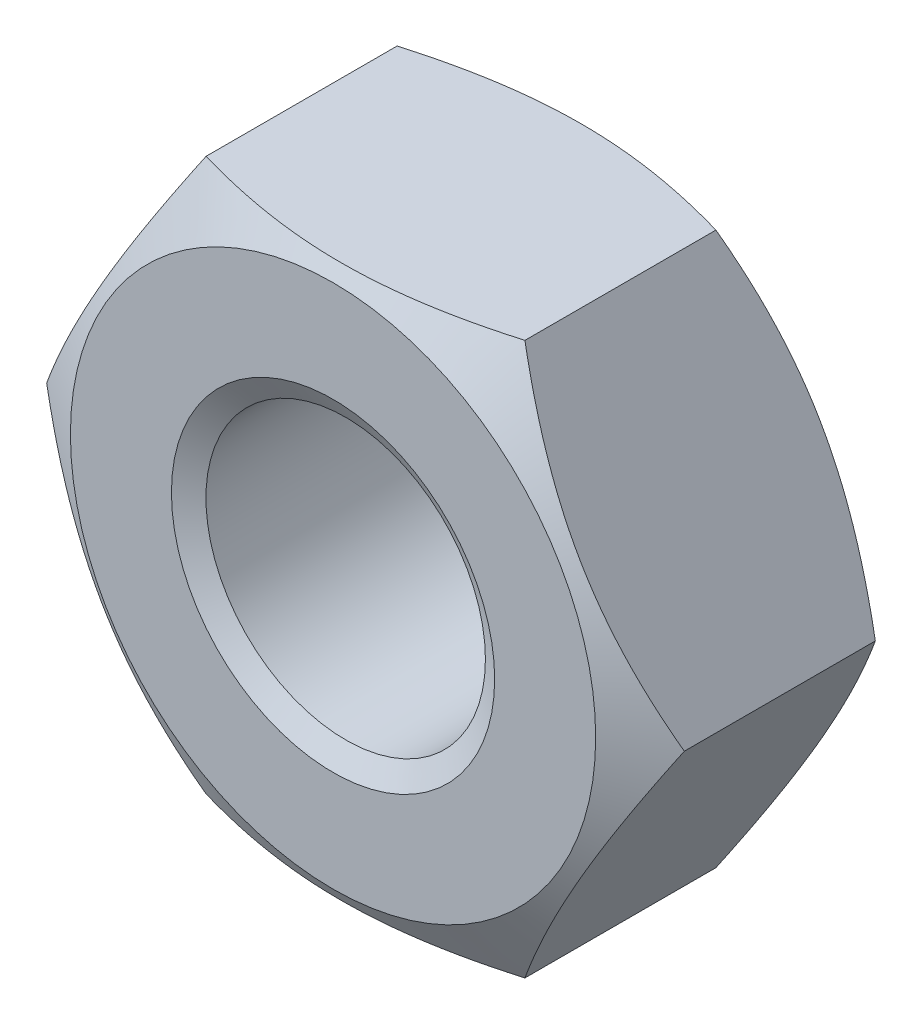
ISO-10303-21;
HEADER;
FILE_DESCRIPTION(('STEP AP214'),'2;1');
FILE_NAME('part.step','',(''),(''),'','','');
FILE_SCHEMA(('AUTOMOTIVE_DESIGN { 1 0 10303 214 1 1 1 1 }'));
ENDSEC;
DATA;
#1=APPLICATION_CONTEXT('core data for automotive mechanical design processes');
#2=APPLICATION_PROTOCOL_DEFINITION('international standard','automotive_design',2000,#1);
#3=PRODUCT_CONTEXT('',#1,'mechanical');
#4=PRODUCT('Part','Part','',(#3));
#5=PRODUCT_RELATED_PRODUCT_CATEGORY('part','',(#4));
#6=PRODUCT_DEFINITION_FORMATION('','',#4);
#7=PRODUCT_DEFINITION_CONTEXT('part definition',#1,'design');
#8=PRODUCT_DEFINITION('design','',#6,#7);
#9=PRODUCT_DEFINITION_SHAPE('','',#8);
#10=(LENGTH_UNIT() NAMED_UNIT(*) SI_UNIT(.MILLI.,.METRE.));
#11=(NAMED_UNIT(*) PLANE_ANGLE_UNIT() SI_UNIT($,.RADIAN.));
#12=(NAMED_UNIT(*) SI_UNIT($,.STERADIAN.) SOLID_ANGLE_UNIT());
#13=UNCERTAINTY_MEASURE_WITH_UNIT(LENGTH_MEASURE(1.E-05),#10,'distance_accuracy_value','');
#14=(GEOMETRIC_REPRESENTATION_CONTEXT(3) GLOBAL_UNCERTAINTY_ASSIGNED_CONTEXT((#13)) GLOBAL_UNIT_ASSIGNED_CONTEXT((#10,
#11,#12)) REPRESENTATION_CONTEXT('',''));
#15=CARTESIAN_POINT('',(0.,0.,0.));
#16=DIRECTION('',(0.,0.,1.));
#17=DIRECTION('',(1.,0.,0.));
#18=AXIS2_PLACEMENT_3D('',#15,#16,#17);
#19=CARTESIAN_POINT('',(0.,0.,0.468736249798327));
#20=DIRECTION('',(0.,0.,-1.));
#21=DIRECTION('',(1.,0.,0.));
#22=AXIS2_PLACEMENT_3D('',#19,#20,#21);
#23=CONICAL_SURFACE('',#22,11.188125,1.0471975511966);
#24=CARTESIAN_POINT('',(0.,0.,0.937472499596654));
#25=DIRECTION('',(0.,0.,1.));
#26=DIRECTION('',(1.,0.,0.));
#27=AXIS2_PLACEMENT_3D('',#24,#25,#26);
#28=CIRCLE('',#27,10.37625);
#29=CARTESIAN_POINT('',(10.37625,0.,0.937472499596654));
#30=VERTEX_POINT('',#29);
#31=EDGE_CURVE('E12',#30,#30,#28,.T.);
#32=ORIENTED_EDGE('',*,*,#31,.T.);
#33=EDGE_LOOP('',(#32));
#34=FACE_BOUND('',#33,.T.);
#35=CARTESIAN_POINT('',(0.,0.,0.));
#36=DIRECTION('',(0.,0.,1.));
#37=DIRECTION('',(1.,0.,0.));
#38=AXIS2_PLACEMENT_3D('',#35,#36,#37);
#39=CIRCLE('',#38,12.);
#40=CARTESIAN_POINT('',(12.,0.,0.));
#41=VERTEX_POINT('',#40);
#42=EDGE_CURVE('E194',#41,#41,#39,.T.);
#43=ORIENTED_EDGE('',*,*,#42,.F.);
#44=EDGE_LOOP('',(#43));
#45=FACE_BOUND('',#44,.T.);
#46=ADVANCED_FACE('F19',(#34,#45),#23,.F.);
#47=CARTESIAN_POINT('',(0.,0.,9.5));
#48=DIRECTION('',(0.,0.,-1.));
#49=DIRECTION('',(1.,0.,0.));
#50=AXIS2_PLACEMENT_3D('',#47,#48,#49);
#51=CYLINDRICAL_SURFACE('',#50,10.37625);
#52=CARTESIAN_POINT('',(0.,0.,18.0625275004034));
#53=DIRECTION('',(0.,0.,1.));
#54=DIRECTION('',(1.,0.,0.));
#55=AXIS2_PLACEMENT_3D('',#52,#53,#54);
#56=CIRCLE('',#55,10.37625);
#57=CARTESIAN_POINT('',(10.37625,0.,18.0625275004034));
#58=VERTEX_POINT('',#57);
#59=EDGE_CURVE('E30',#58,#58,#56,.T.);
#60=ORIENTED_EDGE('',*,*,#59,.T.);
#61=EDGE_LOOP('',(#60));
#62=FACE_BOUND('',#61,.T.);
#63=ORIENTED_EDGE('',*,*,#31,.F.);
#64=EDGE_LOOP('',(#63));
#65=FACE_BOUND('',#64,.T.);
#66=ADVANCED_FACE('F265',(#62,#65),#51,.F.);
#67=CARTESIAN_POINT('',(0.,0.,18.5312637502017));
#68=DIRECTION('',(0.,0.,1.));
#69=DIRECTION('',(1.,0.,0.));
#70=AXIS2_PLACEMENT_3D('',#67,#68,#69);
#71=CONICAL_SURFACE('',#70,11.188125,1.0471975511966);
#72=CARTESIAN_POINT('',(0.,0.,19.));
#73=DIRECTION('',(0.,0.,-1.));
#74=DIRECTION('',(1.,0.,0.));
#75=AXIS2_PLACEMENT_3D('',#72,#73,#74);
#76=CIRCLE('',#75,12.);
#77=CARTESIAN_POINT('',(12.,0.,19.));
#78=VERTEX_POINT('',#77);
#79=EDGE_CURVE('E117',#78,#78,#76,.T.);
#80=ORIENTED_EDGE('',*,*,#79,.F.);
#81=EDGE_LOOP('',(#80));
#82=FACE_BOUND('',#81,.T.);
#83=ORIENTED_EDGE('',*,*,#59,.F.);
#84=EDGE_LOOP('',(#83));
#85=FACE_BOUND('',#84,.T.);
#86=ADVANCED_FACE('F262',(#82,#85),#71,.F.);
#87=CARTESIAN_POINT('',(0.,0.,1.20416820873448));
#88=DIRECTION('',(0.,0.,1.));
#89=DIRECTION('',(1.,0.,0.));
#90=AXIS2_PLACEMENT_3D('',#87,#88,#89);
#91=CONICAL_SURFACE('',#90,21.5856805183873,1.0471975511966);
#92=CARTESIAN_POINT('',(23.6713610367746,0.,2.40833641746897));
#93=CARTESIAN_POINT('',(17.753520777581,-10.25,-1.0083302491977));
#94=CARTESIAN_POINT('',(11.8356805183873,-20.5,2.40833641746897));
#95=(BOUNDED_CURVE() B_SPLINE_CURVE(2,(#92,#93,#94),.UNSPECIFIED.,.F.,
.F.) B_SPLINE_CURVE_WITH_KNOTS((3,3),(0.,23.9529408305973),
.UNSPECIFIED.) CURVE() GEOMETRIC_REPRESENTATION_ITEM() RATIONAL_B_SPLINE_CURVE((1.,
1.15470053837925,1.)) REPRESENTATION_ITEM(''));
#96=CARTESIAN_POINT('',(23.6713610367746,0.,2.40833641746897));
#97=VERTEX_POINT('',#96);
#98=CARTESIAN_POINT('',(11.8356805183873,-20.5,2.40833641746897));
#99=VERTEX_POINT('',#98);
#100=EDGE_CURVE('E103',#97,#99,#95,.T.);
#101=ORIENTED_EDGE('',*,*,#100,.T.);
#102=CARTESIAN_POINT('',(11.8356805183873,-20.5,2.40833641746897));
#103=CARTESIAN_POINT('',(0.,-20.5,-1.00833024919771));
#104=CARTESIAN_POINT('',(-11.8356805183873,-20.5,2.40833641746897));
#105=(BOUNDED_CURVE() B_SPLINE_CURVE(2,(#102,#103,#104),.UNSPECIFIED.,.F.,
.F.) B_SPLINE_CURVE_WITH_KNOTS((3,3),(0.,23.9529408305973),
.UNSPECIFIED.) CURVE() GEOMETRIC_REPRESENTATION_ITEM() RATIONAL_B_SPLINE_CURVE((1.,
1.15470053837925,1.)) REPRESENTATION_ITEM(''));
#106=CARTESIAN_POINT('',(-11.8356805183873,-20.5,2.40833641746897));
#107=VERTEX_POINT('',#106);
#108=EDGE_CURVE('E96',#99,#107,#105,.T.);
#109=ORIENTED_EDGE('',*,*,#108,.T.);
#110=CARTESIAN_POINT('',(-11.8356805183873,-20.5,2.40833641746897));
#111=CARTESIAN_POINT('',(-17.753520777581,-10.25,-1.0083302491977));
#112=CARTESIAN_POINT('',(-23.6713610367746,0.,2.40833641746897));
#113=(BOUNDED_CURVE() B_SPLINE_CURVE(2,(#110,#111,#112),.UNSPECIFIED.,.F.,
.F.) B_SPLINE_CURVE_WITH_KNOTS((3,3),(0.,23.9529408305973),
.UNSPECIFIED.) CURVE() GEOMETRIC_REPRESENTATION_ITEM() RATIONAL_B_SPLINE_CURVE((1.,
1.15470053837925,1.)) REPRESENTATION_ITEM(''));
#114=CARTESIAN_POINT('',(-23.6713610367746,0.,2.40833641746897));
#115=VERTEX_POINT('',#114);
#116=EDGE_CURVE('E86',#107,#115,#113,.T.);
#117=ORIENTED_EDGE('',*,*,#116,.T.);
#118=CARTESIAN_POINT('',(-23.6713610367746,0.,2.40833641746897));
#119=CARTESIAN_POINT('',(-17.753520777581,10.25,-1.00833024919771));
#120=CARTESIAN_POINT('',(-11.8356805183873,20.5,2.40833641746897));
#121=(BOUNDED_CURVE() B_SPLINE_CURVE(2,(#118,#119,#120),.UNSPECIFIED.,.F.,
.F.) B_SPLINE_CURVE_WITH_KNOTS((3,3),(0.,23.9529408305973),
.UNSPECIFIED.) CURVE() GEOMETRIC_REPRESENTATION_ITEM() RATIONAL_B_SPLINE_CURVE((1.,
1.15470053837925,1.)) REPRESENTATION_ITEM(''));
#122=CARTESIAN_POINT('',(-11.8356805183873,20.5,2.40833641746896));
#123=VERTEX_POINT('',#122);
#124=EDGE_CURVE('E97',#115,#123,#121,.T.);
#125=ORIENTED_EDGE('',*,*,#124,.T.);
#126=CARTESIAN_POINT('',(-11.8356805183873,20.5,2.40833641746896));
#127=CARTESIAN_POINT('',(0.,20.5,-1.0083302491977));
#128=CARTESIAN_POINT('',(11.8356805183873,20.5,2.40833641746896));
#129=(BOUNDED_CURVE() B_SPLINE_CURVE(2,(#126,#127,#128),.UNSPECIFIED.,.F.,
.F.) B_SPLINE_CURVE_WITH_KNOTS((3,3),(0.,23.9529408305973),
.UNSPECIFIED.) CURVE() GEOMETRIC_REPRESENTATION_ITEM() RATIONAL_B_SPLINE_CURVE((1.,
1.15470053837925,1.)) REPRESENTATION_ITEM(''));
#130=CARTESIAN_POINT('',(11.8356805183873,20.5,2.40833641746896));
#131=VERTEX_POINT('',#130);
#132=EDGE_CURVE('E155',#123,#131,#129,.T.);
#133=ORIENTED_EDGE('',*,*,#132,.T.);
#134=CARTESIAN_POINT('',(11.8356805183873,20.5,2.40833641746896));
#135=CARTESIAN_POINT('',(17.753520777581,10.25,-1.0083302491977));
#136=CARTESIAN_POINT('',(23.6713610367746,0.,2.40833641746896));
#137=(BOUNDED_CURVE() B_SPLINE_CURVE(2,(#134,#135,#136),.UNSPECIFIED.,.F.,
.F.) B_SPLINE_CURVE_WITH_KNOTS((3,3),(0.,23.9529408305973),
.UNSPECIFIED.) CURVE() GEOMETRIC_REPRESENTATION_ITEM() RATIONAL_B_SPLINE_CURVE((1.,
1.15470053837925,1.)) REPRESENTATION_ITEM(''));
#138=EDGE_CURVE('E148',#131,#97,#137,.T.);
#139=ORIENTED_EDGE('',*,*,#138,.T.);
#140=EDGE_LOOP('',(#101,#109,#117,#125,#133,#139));
#141=FACE_BOUND('',#140,.T.);
#142=CARTESIAN_POINT('',(0.,0.,0.));
#143=DIRECTION('',(0.,0.,1.));
#144=DIRECTION('',(1.,0.,0.));
#145=AXIS2_PLACEMENT_3D('',#142,#143,#144);
#146=CIRCLE('',#145,19.5);
#147=CARTESIAN_POINT('',(19.5,0.,0.));
#148=VERTEX_POINT('',#147);
#149=EDGE_CURVE('E156',#148,#148,#146,.T.);
#150=ORIENTED_EDGE('',*,*,#149,.T.);
#151=EDGE_LOOP('',(#150));
#152=FACE_BOUND('',#151,.T.);
#153=ADVANCED_FACE('F100',(#141,#152),#91,.T.);
#154=CARTESIAN_POINT('',(0.,0.,17.7958317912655));
#155=DIRECTION('',(0.,0.,-1.));
#156=DIRECTION('',(1.,0.,0.));
#157=AXIS2_PLACEMENT_3D('',#154,#155,#156);
#158=CONICAL_SURFACE('',#157,21.5856805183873,1.0471975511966);
#159=CARTESIAN_POINT('',(11.8356805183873,-20.5,16.591663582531));
#160=CARTESIAN_POINT('',(17.753520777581,-10.25,20.0083302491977));
#161=CARTESIAN_POINT('',(23.6713610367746,0.,16.591663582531));
#162=(BOUNDED_CURVE() B_SPLINE_CURVE(2,(#159,#160,#161),.UNSPECIFIED.,.F.,
.F.) B_SPLINE_CURVE_WITH_KNOTS((3,3),(0.,23.9529408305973),
.UNSPECIFIED.) CURVE() GEOMETRIC_REPRESENTATION_ITEM() RATIONAL_B_SPLINE_CURVE((1.,
1.15470053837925,1.)) REPRESENTATION_ITEM(''));
#163=CARTESIAN_POINT('',(11.8356805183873,-20.5,16.591663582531));
#164=VERTEX_POINT('',#163);
#165=CARTESIAN_POINT('',(23.6713610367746,0.,16.591663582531));
#166=VERTEX_POINT('',#165);
#167=EDGE_CURVE('E178',#164,#166,#162,.T.);
#168=ORIENTED_EDGE('',*,*,#167,.T.);
#169=CARTESIAN_POINT('',(23.6713610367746,0.,16.591663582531));
#170=CARTESIAN_POINT('',(17.753520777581,10.25,20.0083302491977));
#171=CARTESIAN_POINT('',(11.8356805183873,20.5,16.591663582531));
#172=(BOUNDED_CURVE() B_SPLINE_CURVE(2,(#169,#170,#171),.UNSPECIFIED.,.F.,
.F.) B_SPLINE_CURVE_WITH_KNOTS((3,3),(0.,23.9529408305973),
.UNSPECIFIED.) CURVE() GEOMETRIC_REPRESENTATION_ITEM() RATIONAL_B_SPLINE_CURVE((1.,
1.15470053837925,1.)) REPRESENTATION_ITEM(''));
#173=CARTESIAN_POINT('',(11.8356805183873,20.5,16.591663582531));
#174=VERTEX_POINT('',#173);
#175=EDGE_CURVE('E127',#166,#174,#172,.T.);
#176=ORIENTED_EDGE('',*,*,#175,.T.);
#177=CARTESIAN_POINT('',(11.8356805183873,20.5,16.591663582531));
#178=CARTESIAN_POINT('',(0.,20.5,20.0083302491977));
#179=CARTESIAN_POINT('',(-11.8356805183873,20.5,16.591663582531));
#180=(BOUNDED_CURVE() B_SPLINE_CURVE(2,(#177,#178,#179),.UNSPECIFIED.,.F.,
.F.) B_SPLINE_CURVE_WITH_KNOTS((3,3),(0.,23.9529408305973),
.UNSPECIFIED.) CURVE() GEOMETRIC_REPRESENTATION_ITEM() RATIONAL_B_SPLINE_CURVE((1.,
1.15470053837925,1.)) REPRESENTATION_ITEM(''));
#181=CARTESIAN_POINT('',(-11.8356805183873,20.5,16.591663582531));
#182=VERTEX_POINT('',#181);
#183=EDGE_CURVE('E231',#174,#182,#180,.T.);
#184=ORIENTED_EDGE('',*,*,#183,.T.);
#185=CARTESIAN_POINT('',(-11.8356805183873,20.5,16.591663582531));
#186=CARTESIAN_POINT('',(-17.753520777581,10.25,20.0083302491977));
#187=CARTESIAN_POINT('',(-23.6713610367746,0.,16.591663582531));
#188=(BOUNDED_CURVE() B_SPLINE_CURVE(2,(#185,#186,#187),.UNSPECIFIED.,.F.,
.F.) B_SPLINE_CURVE_WITH_KNOTS((3,3),(0.,23.9529408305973),
.UNSPECIFIED.) CURVE() GEOMETRIC_REPRESENTATION_ITEM() RATIONAL_B_SPLINE_CURVE((1.,
1.15470053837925,1.)) REPRESENTATION_ITEM(''));
#189=CARTESIAN_POINT('',(-23.6713610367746,0.,16.591663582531));
#190=VERTEX_POINT('',#189);
#191=EDGE_CURVE('E126',#182,#190,#188,.T.);
#192=ORIENTED_EDGE('',*,*,#191,.T.);
#193=CARTESIAN_POINT('',(-23.6713610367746,0.,16.591663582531));
#194=CARTESIAN_POINT('',(-17.753520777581,-10.25,20.0083302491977));
#195=CARTESIAN_POINT('',(-11.8356805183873,-20.5,16.591663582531));
#196=(BOUNDED_CURVE() B_SPLINE_CURVE(2,(#193,#194,#195),.UNSPECIFIED.,.F.,
.F.) B_SPLINE_CURVE_WITH_KNOTS((3,3),(0.,23.9529408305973),
.UNSPECIFIED.) CURVE() GEOMETRIC_REPRESENTATION_ITEM() RATIONAL_B_SPLINE_CURVE((1.,
1.15470053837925,1.)) REPRESENTATION_ITEM(''));
#197=CARTESIAN_POINT('',(-11.8356805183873,-20.5,16.591663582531));
#198=VERTEX_POINT('',#197);
#199=EDGE_CURVE('E120',#190,#198,#196,.T.);
#200=ORIENTED_EDGE('',*,*,#199,.T.);
#201=CARTESIAN_POINT('',(-11.8356805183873,-20.5,16.591663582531));
#202=CARTESIAN_POINT('',(0.,-20.5,20.0083302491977));
#203=CARTESIAN_POINT('',(11.8356805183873,-20.5,16.591663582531));
#204=(BOUNDED_CURVE() B_SPLINE_CURVE(2,(#201,#202,#203),.UNSPECIFIED.,.F.,
.F.) B_SPLINE_CURVE_WITH_KNOTS((3,3),(0.,23.9529408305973),
.UNSPECIFIED.) CURVE() GEOMETRIC_REPRESENTATION_ITEM() RATIONAL_B_SPLINE_CURVE((1.,
1.15470053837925,1.)) REPRESENTATION_ITEM(''));
#205=EDGE_CURVE('E110',#198,#164,#204,.T.);
#206=ORIENTED_EDGE('',*,*,#205,.T.);
#207=EDGE_LOOP('',(#168,#176,#184,#192,#200,#206));
#208=FACE_BOUND('',#207,.T.);
#209=CARTESIAN_POINT('',(0.,0.,19.));
#210=DIRECTION('',(0.,0.,-1.));
#211=DIRECTION('',(1.,0.,0.));
#212=AXIS2_PLACEMENT_3D('',#209,#210,#211);
#213=CIRCLE('',#212,19.5);
#214=CARTESIAN_POINT('',(19.5,0.,19.));
#215=VERTEX_POINT('',#214);
#216=EDGE_CURVE('E146',#215,#215,#213,.T.);
#217=ORIENTED_EDGE('',*,*,#216,.T.);
#218=EDGE_LOOP('',(#217));
#219=FACE_BOUND('',#218,.T.);
#220=ADVANCED_FACE('F21',(#208,#219),#158,.T.);
#221=CARTESIAN_POINT('',(-17.753520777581,10.25,0.));
#222=DIRECTION('',(-0.866025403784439,0.5,0.));
#223=DIRECTION('',(-0.5,-0.866025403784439,0.));
#224=AXIS2_PLACEMENT_3D('',#221,#222,#223);
#225=PLANE('',#224);
#226=ORIENTED_EDGE('',*,*,#191,.F.);
#227=DIRECTION('',(0.,0.,1.));
#228=VECTOR('',#227,1.);
#229=CARTESIAN_POINT('',(-11.8356805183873,20.5,0.));
#230=LINE('',#229,#228);
#231=EDGE_CURVE('E202',#123,#182,#230,.T.);
#232=ORIENTED_EDGE('',*,*,#231,.F.);
#233=ORIENTED_EDGE('',*,*,#124,.F.);
#234=DIRECTION('',(0.,0.,1.));
#235=VECTOR('',#234,1.);
#236=CARTESIAN_POINT('',(-23.6713610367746,0.,0.));
#237=LINE('',#236,#235);
#238=EDGE_CURVE('E92',#115,#190,#237,.T.);
#239=ORIENTED_EDGE('',*,*,#238,.T.);
#240=EDGE_LOOP('',(#226,#232,#233,#239));
#241=FACE_BOUND('',#240,.T.);
#242=ADVANCED_FACE('F248',(#241),#225,.T.);
#243=CARTESIAN_POINT('',(0.,20.5,0.));
#244=DIRECTION('',(0.,1.,0.));
#245=DIRECTION('',(-1.,0.,0.));
#246=AXIS2_PLACEMENT_3D('',#243,#244,#245);
#247=PLANE('',#246);
#248=ORIENTED_EDGE('',*,*,#183,.F.);
#249=DIRECTION('',(0.,0.,1.));
#250=VECTOR('',#249,1.);
#251=CARTESIAN_POINT('',(11.8356805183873,20.5,0.));
#252=LINE('',#251,#250);
#253=EDGE_CURVE('E199',#131,#174,#252,.T.);
#254=ORIENTED_EDGE('',*,*,#253,.F.);
#255=ORIENTED_EDGE('',*,*,#132,.F.);
#256=ORIENTED_EDGE('',*,*,#231,.T.);
#257=EDGE_LOOP('',(#248,#254,#255,#256));
#258=FACE_BOUND('',#257,.T.);
#259=ADVANCED_FACE('F289',(#258),#247,.T.);
#260=CARTESIAN_POINT('',(17.753520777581,10.25,0.));
#261=DIRECTION('',(0.866025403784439,0.5,0.));
#262=DIRECTION('',(-0.5,0.866025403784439,0.));
#263=AXIS2_PLACEMENT_3D('',#260,#261,#262);
#264=PLANE('',#263);
#265=ORIENTED_EDGE('',*,*,#175,.F.);
#266=DIRECTION('',(0.,0.,1.));
#267=VECTOR('',#266,1.);
#268=CARTESIAN_POINT('',(23.6713610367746,0.,0.));
#269=LINE('',#268,#267);
#270=EDGE_CURVE('E23',#97,#166,#269,.T.);
#271=ORIENTED_EDGE('',*,*,#270,.F.);
#272=ORIENTED_EDGE('',*,*,#138,.F.);
#273=ORIENTED_EDGE('',*,*,#253,.T.);
#274=EDGE_LOOP('',(#265,#271,#272,#273));
#275=FACE_BOUND('',#274,.T.);
#276=ADVANCED_FACE('F292',(#275),#264,.T.);
#277=CARTESIAN_POINT('',(17.753520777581,-10.25,0.));
#278=DIRECTION('',(0.866025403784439,-0.5,0.));
#279=DIRECTION('',(0.5,0.866025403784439,0.));
#280=AXIS2_PLACEMENT_3D('',#277,#278,#279);
#281=PLANE('',#280);
#282=ORIENTED_EDGE('',*,*,#167,.F.);
#283=DIRECTION('',(0.,0.,1.));
#284=VECTOR('',#283,1.);
#285=CARTESIAN_POINT('',(11.8356805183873,-20.5,0.));
#286=LINE('',#285,#284);
#287=EDGE_CURVE('E113',#99,#164,#286,.T.);
#288=ORIENTED_EDGE('',*,*,#287,.F.);
#289=ORIENTED_EDGE('',*,*,#100,.F.);
#290=ORIENTED_EDGE('',*,*,#270,.T.);
#291=EDGE_LOOP('',(#282,#288,#289,#290));
#292=FACE_BOUND('',#291,.T.);
#293=ADVANCED_FACE('F282',(#292),#281,.T.);
#294=CARTESIAN_POINT('',(0.,0.,0.));
#295=DIRECTION('',(0.,0.,1.));
#296=DIRECTION('',(0.,-1.,0.));
#297=AXIS2_PLACEMENT_3D('',#294,#295,#296);
#298=PLANE('',#297);
#299=ORIENTED_EDGE('',*,*,#42,.T.);
#300=EDGE_LOOP('',(#299));
#301=FACE_BOUND('',#300,.T.);
#302=ORIENTED_EDGE('',*,*,#149,.F.);
#303=EDGE_LOOP('',(#302));
#304=FACE_BOUND('',#303,.T.);
#305=ADVANCED_FACE('F280',(#301,#304),#298,.F.);
#306=CARTESIAN_POINT('',(0.,0.,19.));
#307=DIRECTION('',(0.,0.,1.));
#308=DIRECTION('',(0.,-1.,0.));
#309=AXIS2_PLACEMENT_3D('',#306,#307,#308);
#310=PLANE('',#309);
#311=ORIENTED_EDGE('',*,*,#79,.T.);
#312=EDGE_LOOP('',(#311));
#313=FACE_BOUND('',#312,.T.);
#314=ORIENTED_EDGE('',*,*,#216,.F.);
#315=EDGE_LOOP('',(#314));
#316=FACE_BOUND('',#315,.T.);
#317=ADVANCED_FACE('F259',(#313,#316),#310,.T.);
#318=CARTESIAN_POINT('',(0.,-20.5,0.));
#319=DIRECTION('',(0.,-1.,0.));
#320=DIRECTION('',(1.,0.,0.));
#321=AXIS2_PLACEMENT_3D('',#318,#319,#320);
#322=PLANE('',#321);
#323=ORIENTED_EDGE('',*,*,#205,.F.);
#324=DIRECTION('',(0.,0.,1.));
#325=VECTOR('',#324,1.);
#326=CARTESIAN_POINT('',(-11.8356805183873,-20.5,0.));
#327=LINE('',#326,#325);
#328=EDGE_CURVE('E90',#107,#198,#327,.T.);
#329=ORIENTED_EDGE('',*,*,#328,.F.);
#330=ORIENTED_EDGE('',*,*,#108,.F.);
#331=ORIENTED_EDGE('',*,*,#287,.T.);
#332=EDGE_LOOP('',(#323,#329,#330,#331));
#333=FACE_BOUND('',#332,.T.);
#334=ADVANCED_FACE('F109',(#333),#322,.T.);
#335=CARTESIAN_POINT('',(-17.753520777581,-10.25,0.));
#336=DIRECTION('',(-0.866025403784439,-0.5,0.));
#337=DIRECTION('',(0.5,-0.866025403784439,0.));
#338=AXIS2_PLACEMENT_3D('',#335,#336,#337);
#339=PLANE('',#338);
#340=ORIENTED_EDGE('',*,*,#199,.F.);
#341=ORIENTED_EDGE('',*,*,#238,.F.);
#342=ORIENTED_EDGE('',*,*,#116,.F.);
#343=ORIENTED_EDGE('',*,*,#328,.T.);
#344=EDGE_LOOP('',(#340,#341,#342,#343));
#345=FACE_BOUND('',#344,.T.);
#346=ADVANCED_FACE('F88',(#345),#339,.T.);
#347=CLOSED_SHELL('',(#46,#66,#86,#153,#220,#242,#259,#276,#293,#305,#317,#334,#346));
#348=MANIFOLD_SOLID_BREP('B1',#347);
#349=ADVANCED_BREP_SHAPE_REPRESENTATION('',(#18,#348),#14);
#350=SHAPE_DEFINITION_REPRESENTATION(#9,#349);
ENDSEC;
END-ISO-10303-21;
